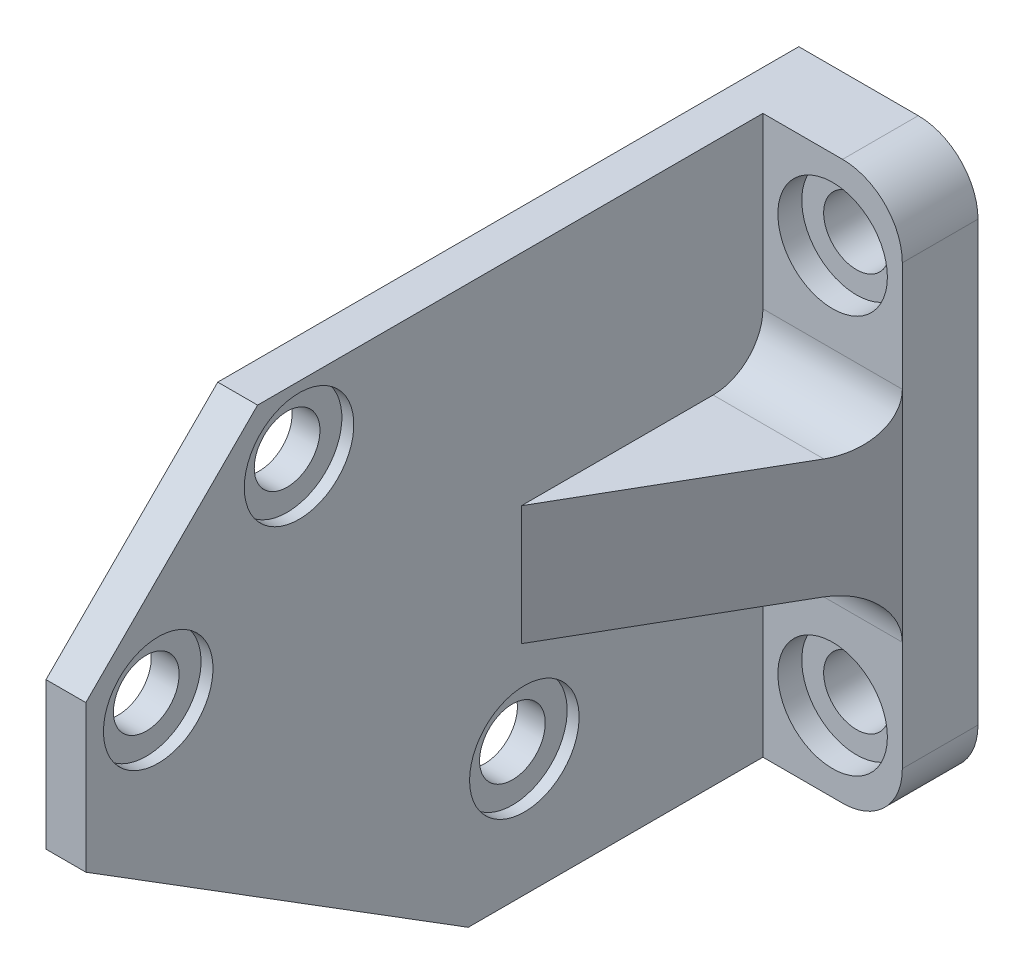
ISO-10303-21;
HEADER;
FILE_DESCRIPTION(('STEP AP214'),'2;1');
FILE_NAME('part.step','',(''),(''),'','','');
FILE_SCHEMA(('AUTOMOTIVE_DESIGN { 1 0 10303 214 1 1 1 1 }'));
ENDSEC;
DATA;
#1=APPLICATION_CONTEXT('core data for automotive mechanical design processes');
#2=APPLICATION_PROTOCOL_DEFINITION('international standard','automotive_design',2000,#1);
#3=PRODUCT_CONTEXT('',#1,'mechanical');
#4=PRODUCT('Part','Part','',(#3));
#5=PRODUCT_RELATED_PRODUCT_CATEGORY('part','',(#4));
#6=PRODUCT_DEFINITION_FORMATION('','',#4);
#7=PRODUCT_DEFINITION_CONTEXT('part definition',#1,'design');
#8=PRODUCT_DEFINITION('design','',#6,#7);
#9=PRODUCT_DEFINITION_SHAPE('','',#8);
#10=(LENGTH_UNIT() NAMED_UNIT(*) SI_UNIT(.MILLI.,.METRE.));
#11=(NAMED_UNIT(*) PLANE_ANGLE_UNIT() SI_UNIT($,.RADIAN.));
#12=(NAMED_UNIT(*) SI_UNIT($,.STERADIAN.) SOLID_ANGLE_UNIT());
#13=UNCERTAINTY_MEASURE_WITH_UNIT(LENGTH_MEASURE(1.E-05),#10,'distance_accuracy_value','');
#14=(GEOMETRIC_REPRESENTATION_CONTEXT(3) GLOBAL_UNCERTAINTY_ASSIGNED_CONTEXT((#13)) GLOBAL_UNIT_ASSIGNED_CONTEXT((#10,
#11,#12)) REPRESENTATION_CONTEXT('',''));
#15=CARTESIAN_POINT('',(0.,0.,0.));
#16=DIRECTION('',(0.,0.,1.));
#17=DIRECTION('',(1.,0.,0.));
#18=AXIS2_PLACEMENT_3D('',#15,#16,#17);
#19=CARTESIAN_POINT('',(0.,0.,0.));
#20=DIRECTION('',(0.,0.,-1.));
#21=DIRECTION('',(1.,0.,0.));
#22=AXIS2_PLACEMENT_3D('',#19,#20,#21);
#23=PLANE('',#22);
#24=CARTESIAN_POINT('',(19.5,-10.,0.));
#25=DIRECTION('',(0.,0.,1.));
#26=DIRECTION('',(1.,0.,0.));
#27=AXIS2_PLACEMENT_3D('',#24,#25,#26);
#28=CIRCLE('',#27,2.75);
#29=CARTESIAN_POINT('',(22.25,-10.,0.));
#30=VERTEX_POINT('',#29);
#31=EDGE_CURVE('E200',#30,#30,#28,.T.);
#32=ORIENTED_EDGE('',*,*,#31,.F.);
#33=EDGE_LOOP('',(#32));
#34=FACE_BOUND('',#33,.T.);
#35=DIRECTION('',(0.,-1.,0.));
#36=VECTOR('',#35,1.);
#37=CARTESIAN_POINT('',(23.,-14.,0.));
#38=LINE('',#37,#36);
#39=CARTESIAN_POINT('',(23.,-5.5,0.));
#40=VERTEX_POINT('',#39);
#41=CARTESIAN_POINT('',(23.,-11.,0.));
#42=VERTEX_POINT('',#41);
#43=EDGE_CURVE('E203',#40,#42,#38,.T.);
#44=ORIENTED_EDGE('',*,*,#43,.F.);
#45=DIRECTION('',(-1.,0.,0.));
#46=VECTOR('',#45,1.);
#47=CARTESIAN_POINT('',(16.,-5.5,0.));
#48=LINE('',#47,#46);
#49=CARTESIAN_POINT('',(16.,-5.5,0.));
#50=VERTEX_POINT('',#49);
#51=EDGE_CURVE('E327',#40,#50,#48,.T.);
#52=ORIENTED_EDGE('',*,*,#51,.T.);
#53=DIRECTION('',(0.,1.,0.));
#54=VECTOR('',#53,1.);
#55=CARTESIAN_POINT('',(16.,-14.,0.));
#56=LINE('',#55,#54);
#57=CARTESIAN_POINT('',(16.,-14.,0.));
#58=VERTEX_POINT('',#57);
#59=EDGE_CURVE('E211',#58,#50,#56,.T.);
#60=ORIENTED_EDGE('',*,*,#59,.F.);
#61=DIRECTION('',(-1.,0.,0.));
#62=VECTOR('',#61,1.);
#63=CARTESIAN_POINT('',(23.,-14.,0.));
#64=LINE('',#63,#62);
#65=CARTESIAN_POINT('',(20.,-14.,0.));
#66=VERTEX_POINT('',#65);
#67=EDGE_CURVE('E208',#66,#58,#64,.T.);
#68=ORIENTED_EDGE('',*,*,#67,.F.);
#69=CARTESIAN_POINT('',(20.,-11.,0.));
#70=DIRECTION('',(0.,0.,-1.));
#71=DIRECTION('',(-1.,0.,0.));
#72=AXIS2_PLACEMENT_3D('',#69,#70,#71);
#73=CIRCLE('',#72,3.);
#74=EDGE_CURVE('E319',#66,#42,#73,.F.);
#75=ORIENTED_EDGE('',*,*,#74,.T.);
#76=EDGE_LOOP('',(#44,#52,#60,#68,#75));
#77=FACE_BOUND('',#76,.T.);
#78=ADVANCED_FACE('F37',(#34,#77),#23,.F.);
#79=CARTESIAN_POINT('',(14.,-14.,34.));
#80=DIRECTION('',(0.,1.,0.));
#81=DIRECTION('',(1.,0.,0.));
#82=AXIS2_PLACEMENT_3D('',#79,#80,#81);
#83=PLANE('',#82);
#84=DIRECTION('',(1.,0.,0.));
#85=VECTOR('',#84,1.);
#86=CARTESIAN_POINT('',(0.,-14.,-3.8));
#87=LINE('',#86,#85);
#88=CARTESIAN_POINT('',(14.,-14.,-3.8));
#89=VERTEX_POINT('',#88);
#90=CARTESIAN_POINT('',(20.,-14.,-3.8));
#91=VERTEX_POINT('',#90);
#92=EDGE_CURVE('E222',#89,#91,#87,.T.);
#93=ORIENTED_EDGE('',*,*,#92,.T.);
#94=DIRECTION('',(0.,0.,-1.));
#95=VECTOR('',#94,1.);
#96=CARTESIAN_POINT('',(20.,-14.,34.));
#97=LINE('',#96,#95);
#98=EDGE_CURVE('E317',#91,#66,#97,.F.);
#99=ORIENTED_EDGE('',*,*,#98,.T.);
#100=ORIENTED_EDGE('',*,*,#67,.T.);
#101=DIRECTION('',(0.,0.,-1.));
#102=VECTOR('',#101,1.);
#103=CARTESIAN_POINT('',(16.,-14.,34.));
#104=LINE('',#103,#102);
#105=CARTESIAN_POINT('',(16.,-14.,14.7959856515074));
#106=VERTEX_POINT('',#105);
#107=EDGE_CURVE('E285',#106,#58,#104,.T.);
#108=ORIENTED_EDGE('',*,*,#107,.F.);
#109=DIRECTION('',(1.,0.,0.));
#110=VECTOR('',#109,1.);
#111=CARTESIAN_POINT('',(14.,-14.,14.7959856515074));
#112=LINE('',#111,#110);
#113=CARTESIAN_POINT('',(14.,-14.,14.7959856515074));
#114=VERTEX_POINT('',#113);
#115=EDGE_CURVE('E236',#114,#106,#112,.T.);
#116=ORIENTED_EDGE('',*,*,#115,.F.);
#117=DIRECTION('',(0.,0.,-1.));
#118=VECTOR('',#117,1.);
#119=CARTESIAN_POINT('',(14.,-14.,34.));
#120=LINE('',#119,#118);
#121=EDGE_CURVE('E293',#114,#89,#120,.T.);
#122=ORIENTED_EDGE('',*,*,#121,.T.);
#123=EDGE_LOOP('',(#93,#99,#100,#108,#116,#122));
#124=FACE_BOUND('',#123,.T.);
#125=ADVANCED_FACE('F385',(#124),#83,.F.);
#126=CARTESIAN_POINT('',(14.,14.,34.));
#127=DIRECTION('',(0.,-1.,0.));
#128=DIRECTION('',(-1.,0.,0.));
#129=AXIS2_PLACEMENT_3D('',#126,#127,#128);
#130=PLANE('',#129);
#131=DIRECTION('',(1.,0.,0.));
#132=VECTOR('',#131,1.);
#133=CARTESIAN_POINT('',(23.,14.,0.));
#134=LINE('',#133,#132);
#135=CARTESIAN_POINT('',(16.,14.,0.));
#136=VERTEX_POINT('',#135);
#137=CARTESIAN_POINT('',(20.,14.,0.));
#138=VERTEX_POINT('',#137);
#139=EDGE_CURVE('E214',#136,#138,#134,.T.);
#140=ORIENTED_EDGE('',*,*,#139,.T.);
#141=DIRECTION('',(0.,0.,-1.));
#142=VECTOR('',#141,1.);
#143=CARTESIAN_POINT('',(20.,14.,34.));
#144=LINE('',#143,#142);
#145=CARTESIAN_POINT('',(20.,14.,-3.8));
#146=VERTEX_POINT('',#145);
#147=EDGE_CURVE('E322',#138,#146,#144,.T.);
#148=ORIENTED_EDGE('',*,*,#147,.T.);
#149=DIRECTION('',(-1.,0.,0.));
#150=VECTOR('',#149,1.);
#151=CARTESIAN_POINT('',(0.,14.,-3.8));
#152=LINE('',#151,#150);
#153=CARTESIAN_POINT('',(14.,14.,-3.8));
#154=VERTEX_POINT('',#153);
#155=EDGE_CURVE('E228',#146,#154,#152,.T.);
#156=ORIENTED_EDGE('',*,*,#155,.T.);
#157=DIRECTION('',(0.,0.,-1.));
#158=VECTOR('',#157,1.);
#159=CARTESIAN_POINT('',(14.,14.,34.));
#160=LINE('',#159,#158);
#161=CARTESIAN_POINT('',(14.,14.,25.3758703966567));
#162=VERTEX_POINT('',#161);
#163=EDGE_CURVE('E291',#162,#154,#160,.T.);
#164=ORIENTED_EDGE('',*,*,#163,.F.);
#165=DIRECTION('',(-1.,0.,0.));
#166=VECTOR('',#165,1.);
#167=CARTESIAN_POINT('',(14.,14.,25.3758703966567));
#168=LINE('',#167,#166);
#169=CARTESIAN_POINT('',(16.,14.,25.3758703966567));
#170=VERTEX_POINT('',#169);
#171=EDGE_CURVE('E246',#170,#162,#168,.T.);
#172=ORIENTED_EDGE('',*,*,#171,.F.);
#173=DIRECTION('',(0.,0.,-1.));
#174=VECTOR('',#173,1.);
#175=CARTESIAN_POINT('',(16.,14.,34.));
#176=LINE('',#175,#174);
#177=EDGE_CURVE('E282',#170,#136,#176,.T.);
#178=ORIENTED_EDGE('',*,*,#177,.T.);
#179=EDGE_LOOP('',(#140,#148,#156,#164,#172,#178));
#180=FACE_BOUND('',#179,.T.);
#181=ADVANCED_FACE('F366',(#180),#130,.F.);
#182=CARTESIAN_POINT('',(19.5,-10.,0.));
#183=DIRECTION('',(0.,0.,1.));
#184=DIRECTION('',(-1.,0.,0.));
#185=AXIS2_PLACEMENT_3D('',#182,#183,#184);
#186=CYLINDRICAL_SURFACE('',#185,1.65);
#187=CARTESIAN_POINT('',(19.5,-10.,-1.2));
#188=DIRECTION('',(0.,0.,1.));
#189=DIRECTION('',(1.,0.,0.));
#190=AXIS2_PLACEMENT_3D('',#187,#188,#189);
#191=CIRCLE('',#190,1.65);
#192=CARTESIAN_POINT('',(21.15,-10.,-1.2));
#193=VERTEX_POINT('',#192);
#194=EDGE_CURVE('E196',#193,#193,#191,.F.);
#195=ORIENTED_EDGE('',*,*,#194,.F.);
#196=EDGE_LOOP('',(#195));
#197=FACE_BOUND('',#196,.T.);
#198=CARTESIAN_POINT('',(19.5,-10.,-3.8));
#199=DIRECTION('',(0.,0.,1.));
#200=DIRECTION('',(1.,0.,0.));
#201=AXIS2_PLACEMENT_3D('',#198,#199,#200);
#202=CIRCLE('',#201,1.65);
#203=CARTESIAN_POINT('',(21.15,-10.,-3.8));
#204=VERTEX_POINT('',#203);
#205=EDGE_CURVE('E230',#204,#204,#202,.F.);
#206=ORIENTED_EDGE('',*,*,#205,.T.);
#207=EDGE_LOOP('',(#206));
#208=FACE_BOUND('',#207,.T.);
#209=ADVANCED_FACE('F463',(#197,#208),#186,.F.);
#210=CARTESIAN_POINT('',(19.5,10.,0.));
#211=DIRECTION('',(0.,0.,1.));
#212=DIRECTION('',(-1.,0.,0.));
#213=AXIS2_PLACEMENT_3D('',#210,#211,#212);
#214=CYLINDRICAL_SURFACE('',#213,1.65);
#215=CARTESIAN_POINT('',(19.5,10.,-1.2));
#216=DIRECTION('',(0.,0.,1.));
#217=DIRECTION('',(1.,0.,0.));
#218=AXIS2_PLACEMENT_3D('',#215,#216,#217);
#219=CIRCLE('',#218,1.65);
#220=CARTESIAN_POINT('',(21.15,10.,-1.2));
#221=VERTEX_POINT('',#220);
#222=EDGE_CURVE('E193',#221,#221,#219,.F.);
#223=ORIENTED_EDGE('',*,*,#222,.F.);
#224=EDGE_LOOP('',(#223));
#225=FACE_BOUND('',#224,.T.);
#226=CARTESIAN_POINT('',(19.5,10.,-3.8));
#227=DIRECTION('',(0.,0.,1.));
#228=DIRECTION('',(1.,0.,0.));
#229=AXIS2_PLACEMENT_3D('',#226,#227,#228);
#230=CIRCLE('',#229,1.65);
#231=CARTESIAN_POINT('',(21.15,10.,-3.8));
#232=VERTEX_POINT('',#231);
#233=EDGE_CURVE('E217',#232,#232,#230,.F.);
#234=ORIENTED_EDGE('',*,*,#233,.T.);
#235=EDGE_LOOP('',(#234));
#236=FACE_BOUND('',#235,.T.);
#237=ADVANCED_FACE('F466',(#225,#236),#214,.F.);
#238=CARTESIAN_POINT('',(14.,3.66947788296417,30.3646752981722));
#239=DIRECTION('',(1.,0.,0.));
#240=DIRECTION('',(0.,0.,1.));
#241=AXIS2_PLACEMENT_3D('',#238,#239,#240);
#242=CYLINDRICAL_SURFACE('',#241,1.65);
#243=CARTESIAN_POINT('',(14.,3.66947788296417,30.3646752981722));
#244=DIRECTION('',(-1.,0.,0.));
#245=DIRECTION('',(0.,0.,1.));
#246=AXIS2_PLACEMENT_3D('',#243,#244,#245);
#247=CIRCLE('',#246,1.65);
#248=CARTESIAN_POINT('',(14.,3.66947788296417,32.0146752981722));
#249=VERTEX_POINT('',#248);
#250=EDGE_CURVE('E274',#249,#249,#247,.T.);
#251=ORIENTED_EDGE('',*,*,#250,.T.);
#252=EDGE_LOOP('',(#251));
#253=FACE_BOUND('',#252,.T.);
#254=CARTESIAN_POINT('',(15.4,3.66947788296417,30.3646752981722));
#255=DIRECTION('',(-1.,0.,0.));
#256=DIRECTION('',(0.,0.,1.));
#257=AXIS2_PLACEMENT_3D('',#254,#255,#256);
#258=CIRCLE('',#257,1.65);
#259=CARTESIAN_POINT('',(15.4,3.66947788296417,32.0146752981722));
#260=VERTEX_POINT('',#259);
#261=EDGE_CURVE('E269',#260,#260,#258,.F.);
#262=ORIENTED_EDGE('',*,*,#261,.T.);
#263=EDGE_LOOP('',(#262));
#264=FACE_BOUND('',#263,.T.);
#265=ADVANCED_FACE('F474',(#253,#264),#242,.F.);
#266=CARTESIAN_POINT('',(14.,10.7405456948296,23.2936074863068));
#267=DIRECTION('',(1.,0.,0.));
#268=DIRECTION('',(0.,0.,1.));
#269=AXIS2_PLACEMENT_3D('',#266,#267,#268);
#270=CYLINDRICAL_SURFACE('',#269,1.65);
#271=CARTESIAN_POINT('',(14.,10.7405456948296,23.2936074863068));
#272=DIRECTION('',(-1.,0.,0.));
#273=DIRECTION('',(0.,0.,1.));
#274=AXIS2_PLACEMENT_3D('',#271,#272,#273);
#275=CIRCLE('',#274,1.65);
#276=CARTESIAN_POINT('',(14.,10.7405456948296,24.9436074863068));
#277=VERTEX_POINT('',#276);
#278=EDGE_CURVE('E270',#277,#277,#275,.T.);
#279=ORIENTED_EDGE('',*,*,#278,.T.);
#280=EDGE_LOOP('',(#279));
#281=FACE_BOUND('',#280,.T.);
#282=CARTESIAN_POINT('',(15.4,10.7405456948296,23.2936074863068));
#283=DIRECTION('',(-1.,0.,0.));
#284=DIRECTION('',(0.,0.,1.));
#285=AXIS2_PLACEMENT_3D('',#282,#283,#284);
#286=CIRCLE('',#285,1.65);
#287=CARTESIAN_POINT('',(15.4,10.7405456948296,24.9436074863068));
#288=VERTEX_POINT('',#287);
#289=EDGE_CURVE('E253',#288,#288,#286,.F.);
#290=ORIENTED_EDGE('',*,*,#289,.T.);
#291=EDGE_LOOP('',(#290));
#292=FACE_BOUND('',#291,.T.);
#293=ADVANCED_FACE('F506',(#281,#292),#270,.F.);
#294=CARTESIAN_POINT('',(14.,-7.64423061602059,11.979898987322));
#295=DIRECTION('',(1.,0.,0.));
#296=DIRECTION('',(0.,0.,1.));
#297=AXIS2_PLACEMENT_3D('',#294,#295,#296);
#298=CYLINDRICAL_SURFACE('',#297,1.65);
#299=CARTESIAN_POINT('',(14.,-7.64423061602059,11.979898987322));
#300=DIRECTION('',(-1.,0.,0.));
#301=DIRECTION('',(0.,0.,1.));
#302=AXIS2_PLACEMENT_3D('',#299,#300,#301);
#303=CIRCLE('',#302,1.65);
#304=CARTESIAN_POINT('',(14.,-7.64423061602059,13.629898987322));
#305=VERTEX_POINT('',#304);
#306=EDGE_CURVE('E273',#305,#305,#303,.T.);
#307=ORIENTED_EDGE('',*,*,#306,.T.);
#308=EDGE_LOOP('',(#307));
#309=FACE_BOUND('',#308,.T.);
#310=CARTESIAN_POINT('',(15.4,-7.64423061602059,11.979898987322));
#311=DIRECTION('',(-1.,0.,0.));
#312=DIRECTION('',(0.,0.,1.));
#313=AXIS2_PLACEMENT_3D('',#310,#311,#312);
#314=CIRCLE('',#313,1.65);
#315=CARTESIAN_POINT('',(15.4,-7.64423061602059,13.629898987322));
#316=VERTEX_POINT('',#315);
#317=EDGE_CURVE('E265',#316,#316,#314,.F.);
#318=ORIENTED_EDGE('',*,*,#317,.T.);
#319=EDGE_LOOP('',(#318));
#320=FACE_BOUND('',#319,.T.);
#321=ADVANCED_FACE('F509',(#309,#320),#298,.F.);
#322=CARTESIAN_POINT('',(0.,0.,34.));
#323=DIRECTION('',(0.,0.,1.));
#324=DIRECTION('',(-1.,0.,0.));
#325=AXIS2_PLACEMENT_3D('',#322,#323,#324);
#326=PLANE('',#325);
#327=DIRECTION('',(1.,0.,0.));
#328=VECTOR('',#327,1.);
#329=CARTESIAN_POINT('',(14.,-2.,34.));
#330=LINE('',#329,#328);
#331=CARTESIAN_POINT('',(14.,-2.,34.));
#332=VERTEX_POINT('',#331);
#333=CARTESIAN_POINT('',(16.,-2.,34.));
#334=VERTEX_POINT('',#333);
#335=EDGE_CURVE('E235',#332,#334,#330,.T.);
#336=ORIENTED_EDGE('',*,*,#335,.T.);
#337=DIRECTION('',(0.,1.,0.));
#338=VECTOR('',#337,1.);
#339=CARTESIAN_POINT('',(16.,-14.,34.));
#340=LINE('',#339,#338);
#341=CARTESIAN_POINT('',(16.,5.37587039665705,33.9999999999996));
#342=VERTEX_POINT('',#341);
#343=EDGE_CURVE('E279',#334,#342,#340,.T.);
#344=ORIENTED_EDGE('',*,*,#343,.T.);
#345=DIRECTION('',(1.,0.,0.));
#346=VECTOR('',#345,1.);
#347=CARTESIAN_POINT('',(14.,5.37587039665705,33.9999999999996));
#348=LINE('',#347,#346);
#349=CARTESIAN_POINT('',(14.,5.37587039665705,33.9999999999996));
#350=VERTEX_POINT('',#349);
#351=EDGE_CURVE('E243',#350,#342,#348,.T.);
#352=ORIENTED_EDGE('',*,*,#351,.F.);
#353=DIRECTION('',(0.,1.,0.));
#354=VECTOR('',#353,1.);
#355=CARTESIAN_POINT('',(14.,14.,34.));
#356=LINE('',#355,#354);
#357=EDGE_CURVE('E288',#332,#350,#356,.T.);
#358=ORIENTED_EDGE('',*,*,#357,.F.);
#359=EDGE_LOOP('',(#336,#344,#352,#358));
#360=FACE_BOUND('',#359,.T.);
#361=ADVANCED_FACE('F398',(#360),#326,.T.);
#362=CARTESIAN_POINT('',(14.,14.,34.));
#363=DIRECTION('',(1.,0.,0.));
#364=DIRECTION('',(0.,0.,1.));
#365=AXIS2_PLACEMENT_3D('',#362,#363,#364);
#366=PLANE('',#365);
#367=DIRECTION('',(0.,1.,0.));
#368=VECTOR('',#367,1.);
#369=CARTESIAN_POINT('',(14.,14.,-1.8));
#370=LINE('',#369,#368);
#371=CARTESIAN_POINT('',(14.,-10.5,-1.8));
#372=VERTEX_POINT('',#371);
#373=CARTESIAN_POINT('',(14.,10.5,-1.8));
#374=VERTEX_POINT('',#373);
#375=EDGE_CURVE('E11',#372,#374,#370,.T.);
#376=ORIENTED_EDGE('',*,*,#375,.F.);
#377=DIRECTION('',(0.,0.,-1.));
#378=VECTOR('',#377,1.);
#379=CARTESIAN_POINT('',(14.,-10.5,-1.8));
#380=LINE('',#379,#378);
#381=CARTESIAN_POINT('',(14.,-10.5,-3.8));
#382=VERTEX_POINT('',#381);
#383=EDGE_CURVE('E161',#372,#382,#380,.T.);
#384=ORIENTED_EDGE('',*,*,#383,.T.);
#385=DIRECTION('',(0.,-1.,0.));
#386=VECTOR('',#385,1.);
#387=CARTESIAN_POINT('',(14.,0.,-3.8));
#388=LINE('',#387,#386);
#389=EDGE_CURVE('E220',#382,#89,#388,.T.);
#390=ORIENTED_EDGE('',*,*,#389,.T.);
#391=ORIENTED_EDGE('',*,*,#121,.F.);
#392=DIRECTION('',(0.,-0.529919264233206,-0.848048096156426));
#393=VECTOR('',#392,1.);
#394=CARTESIAN_POINT('',(14.,-2.,34.));
#395=LINE('',#394,#393);
#396=EDGE_CURVE('E233',#332,#114,#395,.T.);
#397=ORIENTED_EDGE('',*,*,#396,.F.);
#398=ORIENTED_EDGE('',*,*,#357,.T.);
#399=DIRECTION('',(0.,-0.707106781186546,0.707106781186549));
#400=VECTOR('',#399,1.);
#401=CARTESIAN_POINT('',(14.,5.37587039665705,33.9999999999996));
#402=LINE('',#401,#400);
#403=EDGE_CURVE('E239',#162,#350,#402,.T.);
#404=ORIENTED_EDGE('',*,*,#403,.F.);
#405=ORIENTED_EDGE('',*,*,#163,.T.);
#406=CARTESIAN_POINT('',(14.,10.5,-3.8));
#407=VERTEX_POINT('',#406);
#408=EDGE_CURVE('E169',#154,#407,#388,.T.);
#409=ORIENTED_EDGE('',*,*,#408,.T.);
#410=DIRECTION('',(0.,0.,-1.));
#411=VECTOR('',#410,1.);
#412=CARTESIAN_POINT('',(14.,10.5,-1.8));
#413=LINE('',#412,#411);
#414=EDGE_CURVE('E52',#407,#374,#413,.F.);
#415=ORIENTED_EDGE('',*,*,#414,.T.);
#416=EDGE_LOOP('',(#376,#384,#390,#391,#397,#398,#404,#405,#409,#415));
#417=FACE_BOUND('',#416,.T.);
#418=ORIENTED_EDGE('',*,*,#278,.F.);
#419=EDGE_LOOP('',(#418));
#420=FACE_BOUND('',#419,.T.);
#421=ORIENTED_EDGE('',*,*,#250,.F.);
#422=EDGE_LOOP('',(#421));
#423=FACE_BOUND('',#422,.T.);
#424=ORIENTED_EDGE('',*,*,#306,.F.);
#425=EDGE_LOOP('',(#424));
#426=FACE_BOUND('',#425,.T.);
#427=ADVANCED_FACE('F165',(#417,#420,#423,#426),#366,.F.);
#428=CARTESIAN_POINT('',(23.,14.,34.));
#429=DIRECTION('',(-1.,0.,0.));
#430=DIRECTION('',(0.,0.,-1.));
#431=AXIS2_PLACEMENT_3D('',#428,#429,#430);
#432=PLANE('',#431);
#433=CARTESIAN_POINT('',(23.,5.5,0.));
#434=VERTEX_POINT('',#433);
#435=EDGE_CURVE('E61',#434,#40,#38,.T.);
#436=ORIENTED_EDGE('',*,*,#435,.T.);
#437=ORIENTED_EDGE('',*,*,#43,.T.);
#438=DIRECTION('',(0.,0.,-1.));
#439=VECTOR('',#438,1.);
#440=CARTESIAN_POINT('',(23.,-11.,34.));
#441=LINE('',#440,#439);
#442=CARTESIAN_POINT('',(23.,-11.,-3.8));
#443=VERTEX_POINT('',#442);
#444=EDGE_CURVE('E310',#42,#443,#441,.T.);
#445=ORIENTED_EDGE('',*,*,#444,.T.);
#446=DIRECTION('',(0.,1.,0.));
#447=VECTOR('',#446,1.);
#448=CARTESIAN_POINT('',(23.,0.,-3.8));
#449=LINE('',#448,#447);
#450=CARTESIAN_POINT('',(23.,11.,-3.8));
#451=VERTEX_POINT('',#450);
#452=EDGE_CURVE('E225',#443,#451,#449,.T.);
#453=ORIENTED_EDGE('',*,*,#452,.T.);
#454=DIRECTION('',(0.,0.,-1.));
#455=VECTOR('',#454,1.);
#456=CARTESIAN_POINT('',(23.,11.,34.));
#457=LINE('',#456,#455);
#458=CARTESIAN_POINT('',(23.,11.,0.));
#459=VERTEX_POINT('',#458);
#460=EDGE_CURVE('E306',#451,#459,#457,.F.);
#461=ORIENTED_EDGE('',*,*,#460,.T.);
#462=EDGE_CURVE('E206',#459,#434,#38,.T.);
#463=ORIENTED_EDGE('',*,*,#462,.T.);
#464=EDGE_LOOP('',(#436,#437,#445,#453,#461,#463));
#465=FACE_BOUND('',#464,.T.);
#466=ADVANCED_FACE('F376',(#465),#432,.F.);
#467=CARTESIAN_POINT('',(16.,-14.,34.));
#468=DIRECTION('',(1.,0.,0.));
#469=DIRECTION('',(0.,0.,1.));
#470=AXIS2_PLACEMENT_3D('',#467,#468,#469);
#471=PLANE('',#470);
#472=ORIENTED_EDGE('',*,*,#59,.T.);
#473=CARTESIAN_POINT('',(16.,-5.5,2.5));
#474=DIRECTION('',(1.,0.,0.));
#475=DIRECTION('',(0.,0.,-1.));
#476=AXIS2_PLACEMENT_3D('',#473,#474,#475);
#477=CIRCLE('',#476,2.5);
#478=CARTESIAN_POINT('',(16.,-3.,2.5));
#479=VERTEX_POINT('',#478);
#480=EDGE_CURVE('E332',#50,#479,#477,.T.);
#481=ORIENTED_EDGE('',*,*,#480,.T.);
#482=DIRECTION('',(0.,0.,-1.));
#483=VECTOR('',#482,1.);
#484=CARTESIAN_POINT('',(16.,-3.,34.));
#485=LINE('',#484,#483);
#486=CARTESIAN_POINT('',(16.,-3.,12.1243556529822));
#487=VERTEX_POINT('',#486);
#488=EDGE_CURVE('E178',#487,#479,#485,.T.);
#489=ORIENTED_EDGE('',*,*,#488,.F.);
#490=DIRECTION('',(0.,-1.,0.));
#491=VECTOR('',#490,1.);
#492=CARTESIAN_POINT('',(16.,-14.,12.1243556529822));
#493=LINE('',#492,#491);
#494=CARTESIAN_POINT('',(16.,3.,12.1243556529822));
#495=VERTEX_POINT('',#494);
#496=EDGE_CURVE('E186',#487,#495,#493,.F.);
#497=ORIENTED_EDGE('',*,*,#496,.T.);
#498=DIRECTION('',(0.,0.,-1.));
#499=VECTOR('',#498,1.);
#500=CARTESIAN_POINT('',(16.,3.,34.));
#501=LINE('',#500,#499);
#502=CARTESIAN_POINT('',(16.,3.,2.5));
#503=VERTEX_POINT('',#502);
#504=EDGE_CURVE('E183',#495,#503,#501,.T.);
#505=ORIENTED_EDGE('',*,*,#504,.T.);
#506=CARTESIAN_POINT('',(16.,5.5,2.5));
#507=DIRECTION('',(1.,0.,0.));
#508=DIRECTION('',(0.,0.,-1.));
#509=AXIS2_PLACEMENT_3D('',#506,#507,#508);
#510=CIRCLE('',#509,2.5);
#511=CARTESIAN_POINT('',(16.,5.5,0.));
#512=VERTEX_POINT('',#511);
#513=EDGE_CURVE('E330',#503,#512,#510,.T.);
#514=ORIENTED_EDGE('',*,*,#513,.T.);
#515=EDGE_CURVE('E210',#512,#136,#56,.T.);
#516=ORIENTED_EDGE('',*,*,#515,.T.);
#517=ORIENTED_EDGE('',*,*,#177,.F.);
#518=DIRECTION('',(0.,-0.707106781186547,0.707106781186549));
#519=VECTOR('',#518,1.);
#520=CARTESIAN_POINT('',(16.,-4.31206480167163,43.6879351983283));
#521=LINE('',#520,#519);
#522=EDGE_CURVE('E296',#170,#342,#521,.T.);
#523=ORIENTED_EDGE('',*,*,#522,.T.);
#524=ORIENTED_EDGE('',*,*,#343,.F.);
#525=DIRECTION('',(0.,-0.529919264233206,-0.848048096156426));
#526=VECTOR('',#525,1.);
#527=CARTESIAN_POINT('',(16.,-5.36977311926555,28.607235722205));
#528=LINE('',#527,#526);
#529=EDGE_CURVE('E304',#334,#106,#528,.T.);
#530=ORIENTED_EDGE('',*,*,#529,.T.);
#531=ORIENTED_EDGE('',*,*,#107,.T.);
#532=EDGE_LOOP('',(#472,#481,#489,#497,#505,#514,#516,#517,#523,#524,#530,#531));
#533=FACE_BOUND('',#532,.T.);
#534=CARTESIAN_POINT('',(16.,10.7405456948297,23.2936074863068));
#535=DIRECTION('',(-1.,0.,0.));
#536=DIRECTION('',(0.,0.,1.));
#537=AXIS2_PLACEMENT_3D('',#534,#535,#536);
#538=CIRCLE('',#537,2.75);
#539=CARTESIAN_POINT('',(16.,10.7405456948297,26.0436074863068));
#540=VERTEX_POINT('',#539);
#541=EDGE_CURVE('E254',#540,#540,#538,.T.);
#542=ORIENTED_EDGE('',*,*,#541,.T.);
#543=EDGE_LOOP('',(#542));
#544=FACE_BOUND('',#543,.T.);
#545=CARTESIAN_POINT('',(16.,3.66947788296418,30.3646752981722));
#546=DIRECTION('',(-1.,0.,0.));
#547=DIRECTION('',(0.,0.,1.));
#548=AXIS2_PLACEMENT_3D('',#545,#546,#547);
#549=CIRCLE('',#548,2.75);
#550=CARTESIAN_POINT('',(16.,3.66947788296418,33.1146752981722));
#551=VERTEX_POINT('',#550);
#552=EDGE_CURVE('E249',#551,#551,#549,.T.);
#553=ORIENTED_EDGE('',*,*,#552,.T.);
#554=EDGE_LOOP('',(#553));
#555=FACE_BOUND('',#554,.T.);
#556=CARTESIAN_POINT('',(16.,-7.64423061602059,11.979898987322));
#557=DIRECTION('',(-1.,0.,0.));
#558=DIRECTION('',(0.,0.,1.));
#559=AXIS2_PLACEMENT_3D('',#556,#557,#558);
#560=CIRCLE('',#559,2.75);
#561=CARTESIAN_POINT('',(16.,-7.64423061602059,14.729898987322));
#562=VERTEX_POINT('',#561);
#563=EDGE_CURVE('E266',#562,#562,#560,.T.);
#564=ORIENTED_EDGE('',*,*,#563,.T.);
#565=EDGE_LOOP('',(#564));
#566=FACE_BOUND('',#565,.T.);
#567=ADVANCED_FACE('F356',(#533,#544,#555,#566),#471,.T.);
#568=CARTESIAN_POINT('',(15.4,-7.64423061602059,11.979898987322));
#569=DIRECTION('',(1.,0.,0.));
#570=DIRECTION('',(0.,0.,1.));
#571=AXIS2_PLACEMENT_3D('',#568,#569,#570);
#572=PLANE('',#571);
#573=CARTESIAN_POINT('',(15.4,-7.64423061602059,11.979898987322));
#574=DIRECTION('',(-1.,0.,0.));
#575=DIRECTION('',(0.,0.,1.));
#576=AXIS2_PLACEMENT_3D('',#573,#574,#575);
#577=CIRCLE('',#576,2.75);
#578=CARTESIAN_POINT('',(15.4,-7.64423061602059,14.729898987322));
#579=VERTEX_POINT('',#578);
#580=EDGE_CURVE('E262',#579,#579,#577,.T.);
#581=ORIENTED_EDGE('',*,*,#580,.F.);
#582=EDGE_LOOP('',(#581));
#583=FACE_BOUND('',#582,.T.);
#584=ORIENTED_EDGE('',*,*,#317,.F.);
#585=EDGE_LOOP('',(#584));
#586=FACE_BOUND('',#585,.T.);
#587=ADVANCED_FACE('F499',(#583,#586),#572,.T.);
#588=CARTESIAN_POINT('',(15.4,-7.64423061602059,11.979898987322));
#589=DIRECTION('',(1.,0.,0.));
#590=DIRECTION('',(0.,0.,1.));
#591=AXIS2_PLACEMENT_3D('',#588,#589,#590);
#592=CYLINDRICAL_SURFACE('',#591,2.75);
#593=ORIENTED_EDGE('',*,*,#580,.T.);
#594=EDGE_LOOP('',(#593));
#595=FACE_BOUND('',#594,.T.);
#596=ORIENTED_EDGE('',*,*,#563,.F.);
#597=EDGE_LOOP('',(#596));
#598=FACE_BOUND('',#597,.T.);
#599=ADVANCED_FACE('F487',(#595,#598),#592,.F.);
#600=CARTESIAN_POINT('',(15.4,10.7405456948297,23.2936074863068));
#601=DIRECTION('',(1.,0.,0.));
#602=DIRECTION('',(0.,0.,1.));
#603=AXIS2_PLACEMENT_3D('',#600,#601,#602);
#604=PLANE('',#603);
#605=CARTESIAN_POINT('',(15.4,10.7405456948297,23.2936074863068));
#606=DIRECTION('',(-1.,0.,0.));
#607=DIRECTION('',(0.,0.,1.));
#608=AXIS2_PLACEMENT_3D('',#605,#606,#607);
#609=CIRCLE('',#608,2.75);
#610=CARTESIAN_POINT('',(15.4,10.7405456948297,26.0436074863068));
#611=VERTEX_POINT('',#610);
#612=EDGE_CURVE('E250',#611,#611,#609,.T.);
#613=ORIENTED_EDGE('',*,*,#612,.F.);
#614=EDGE_LOOP('',(#613));
#615=FACE_BOUND('',#614,.T.);
#616=ORIENTED_EDGE('',*,*,#289,.F.);
#617=EDGE_LOOP('',(#616));
#618=FACE_BOUND('',#617,.T.);
#619=ADVANCED_FACE('F483',(#615,#618),#604,.T.);
#620=CARTESIAN_POINT('',(15.4,10.7405456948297,23.2936074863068));
#621=DIRECTION('',(1.,0.,0.));
#622=DIRECTION('',(0.,0.,1.));
#623=AXIS2_PLACEMENT_3D('',#620,#621,#622);
#624=CYLINDRICAL_SURFACE('',#623,2.75);
#625=ORIENTED_EDGE('',*,*,#612,.T.);
#626=EDGE_LOOP('',(#625));
#627=FACE_BOUND('',#626,.T.);
#628=ORIENTED_EDGE('',*,*,#541,.F.);
#629=EDGE_LOOP('',(#628));
#630=FACE_BOUND('',#629,.T.);
#631=ADVANCED_FACE('F486',(#627,#630),#624,.F.);
#632=CARTESIAN_POINT('',(15.4,3.66947788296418,30.3646752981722));
#633=DIRECTION('',(1.,0.,0.));
#634=DIRECTION('',(0.,0.,1.));
#635=AXIS2_PLACEMENT_3D('',#632,#633,#634);
#636=PLANE('',#635);
#637=CARTESIAN_POINT('',(15.4,3.66947788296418,30.3646752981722));
#638=DIRECTION('',(-1.,0.,0.));
#639=DIRECTION('',(0.,0.,1.));
#640=AXIS2_PLACEMENT_3D('',#637,#638,#639);
#641=CIRCLE('',#640,2.75);
#642=CARTESIAN_POINT('',(15.4,3.66947788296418,33.1146752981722));
#643=VERTEX_POINT('',#642);
#644=EDGE_CURVE('E257',#643,#643,#641,.T.);
#645=ORIENTED_EDGE('',*,*,#644,.F.);
#646=EDGE_LOOP('',(#645));
#647=FACE_BOUND('',#646,.T.);
#648=ORIENTED_EDGE('',*,*,#261,.F.);
#649=EDGE_LOOP('',(#648));
#650=FACE_BOUND('',#649,.T.);
#651=ADVANCED_FACE('F491',(#647,#650),#636,.T.);
#652=CARTESIAN_POINT('',(15.4,3.66947788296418,30.3646752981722));
#653=DIRECTION('',(1.,0.,0.));
#654=DIRECTION('',(0.,0.,1.));
#655=AXIS2_PLACEMENT_3D('',#652,#653,#654);
#656=CYLINDRICAL_SURFACE('',#655,2.75);
#657=ORIENTED_EDGE('',*,*,#644,.T.);
#658=EDGE_LOOP('',(#657));
#659=FACE_BOUND('',#658,.T.);
#660=ORIENTED_EDGE('',*,*,#552,.F.);
#661=EDGE_LOOP('',(#660));
#662=FACE_BOUND('',#661,.T.);
#663=ADVANCED_FACE('F482',(#659,#662),#656,.F.);
#664=CARTESIAN_POINT('',(14.,5.37587039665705,33.9999999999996));
#665=DIRECTION('',(0.,-0.707106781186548,-0.707106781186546));
#666=DIRECTION('',(0.,0.707106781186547,-0.707106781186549));
#667=AXIS2_PLACEMENT_3D('',#664,#665,#666);
#668=PLANE('',#667);
#669=ORIENTED_EDGE('',*,*,#522,.F.);
#670=ORIENTED_EDGE('',*,*,#171,.T.);
#671=ORIENTED_EDGE('',*,*,#403,.T.);
#672=ORIENTED_EDGE('',*,*,#351,.T.);
#673=EDGE_LOOP('',(#669,#670,#671,#672));
#674=FACE_BOUND('',#673,.T.);
#675=ADVANCED_FACE('F393',(#674),#668,.F.);
#676=CARTESIAN_POINT('',(14.,-2.,34.));
#677=DIRECTION('',(0.,0.848048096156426,-0.529919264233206));
#678=DIRECTION('',(0.,0.529919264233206,0.848048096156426));
#679=AXIS2_PLACEMENT_3D('',#676,#677,#678);
#680=PLANE('',#679);
#681=ORIENTED_EDGE('',*,*,#529,.F.);
#682=ORIENTED_EDGE('',*,*,#335,.F.);
#683=ORIENTED_EDGE('',*,*,#396,.T.);
#684=ORIENTED_EDGE('',*,*,#115,.T.);
#685=EDGE_LOOP('',(#681,#682,#683,#684));
#686=FACE_BOUND('',#685,.T.);
#687=ADVANCED_FACE('F400',(#686),#680,.F.);
#688=CARTESIAN_POINT('',(0.,0.,-3.8));
#689=DIRECTION('',(0.,0.,-1.));
#690=DIRECTION('',(1.,0.,0.));
#691=AXIS2_PLACEMENT_3D('',#688,#689,#690);
#692=PLANE('',#691);
#693=CARTESIAN_POINT('',(0.,0.,-3.8));
#694=DIRECTION('',(0.,0.,-1.));
#695=DIRECTION('',(-1.,0.,0.));
#696=AXIS2_PLACEMENT_3D('',#693,#694,#695);
#697=CIRCLE('',#696,17.5);
#698=EDGE_CURVE('E162',#407,#382,#697,.T.);
#699=ORIENTED_EDGE('',*,*,#698,.F.);
#700=ORIENTED_EDGE('',*,*,#408,.F.);
#701=ORIENTED_EDGE('',*,*,#155,.F.);
#702=CARTESIAN_POINT('',(20.,11.,-3.8));
#703=DIRECTION('',(0.,0.,-1.));
#704=DIRECTION('',(-1.,0.,0.));
#705=AXIS2_PLACEMENT_3D('',#702,#703,#704);
#706=CIRCLE('',#705,3.);
#707=EDGE_CURVE('E313',#146,#451,#706,.T.);
#708=ORIENTED_EDGE('',*,*,#707,.T.);
#709=ORIENTED_EDGE('',*,*,#452,.F.);
#710=CARTESIAN_POINT('',(20.,-11.,-3.8));
#711=DIRECTION('',(0.,0.,-1.));
#712=DIRECTION('',(-1.,0.,0.));
#713=AXIS2_PLACEMENT_3D('',#710,#711,#712);
#714=CIRCLE('',#713,3.);
#715=EDGE_CURVE('E315',#443,#91,#714,.T.);
#716=ORIENTED_EDGE('',*,*,#715,.T.);
#717=ORIENTED_EDGE('',*,*,#92,.F.);
#718=ORIENTED_EDGE('',*,*,#389,.F.);
#719=EDGE_LOOP('',(#699,#700,#701,#708,#709,#716,#717,#718));
#720=FACE_BOUND('',#719,.T.);
#721=ORIENTED_EDGE('',*,*,#233,.F.);
#722=EDGE_LOOP('',(#721));
#723=FACE_BOUND('',#722,.T.);
#724=ORIENTED_EDGE('',*,*,#205,.F.);
#725=EDGE_LOOP('',(#724));
#726=FACE_BOUND('',#725,.T.);
#727=ADVANCED_FACE('F374',(#720,#723,#726),#692,.T.);
#728=CARTESIAN_POINT('',(19.5,10.,0.));
#729=DIRECTION('',(0.,0.,1.));
#730=DIRECTION('',(1.,0.,0.));
#731=AXIS2_PLACEMENT_3D('',#728,#729,#730);
#732=CIRCLE('',#731,2.75);
#733=CARTESIAN_POINT('',(22.25,10.,0.));
#734=VERTEX_POINT('',#733);
#735=EDGE_CURVE('E190',#734,#734,#732,.T.);
#736=ORIENTED_EDGE('',*,*,#735,.F.);
#737=EDGE_LOOP('',(#736));
#738=FACE_BOUND('',#737,.T.);
#739=ORIENTED_EDGE('',*,*,#515,.F.);
#740=DIRECTION('',(-1.,0.,0.));
#741=VECTOR('',#740,1.);
#742=CARTESIAN_POINT('',(0.,5.5,0.));
#743=LINE('',#742,#741);
#744=EDGE_CURVE('E339',#512,#434,#743,.F.);
#745=ORIENTED_EDGE('',*,*,#744,.T.);
#746=ORIENTED_EDGE('',*,*,#462,.F.);
#747=CARTESIAN_POINT('',(20.,11.,0.));
#748=DIRECTION('',(0.,0.,-1.));
#749=DIRECTION('',(-1.,0.,0.));
#750=AXIS2_PLACEMENT_3D('',#747,#748,#749);
#751=CIRCLE('',#750,3.);
#752=EDGE_CURVE('E325',#459,#138,#751,.F.);
#753=ORIENTED_EDGE('',*,*,#752,.T.);
#754=ORIENTED_EDGE('',*,*,#139,.F.);
#755=EDGE_LOOP('',(#739,#745,#746,#753,#754));
#756=FACE_BOUND('',#755,.T.);
#757=ADVANCED_FACE('F361',(#738,#756),#23,.F.);
#758=CARTESIAN_POINT('',(19.5,-10.,-1.2));
#759=DIRECTION('',(0.,0.,1.));
#760=DIRECTION('',(-1.,0.,0.));
#761=AXIS2_PLACEMENT_3D('',#758,#759,#760);
#762=CYLINDRICAL_SURFACE('',#761,2.75);
#763=CARTESIAN_POINT('',(19.5,-10.,-1.2));
#764=DIRECTION('',(0.,0.,1.));
#765=DIRECTION('',(1.,0.,0.));
#766=AXIS2_PLACEMENT_3D('',#763,#764,#765);
#767=CIRCLE('',#766,2.75);
#768=CARTESIAN_POINT('',(22.25,-10.,-1.2));
#769=VERTEX_POINT('',#768);
#770=EDGE_CURVE('E199',#769,#769,#767,.T.);
#771=ORIENTED_EDGE('',*,*,#770,.F.);
#772=EDGE_LOOP('',(#771));
#773=FACE_BOUND('',#772,.T.);
#774=ORIENTED_EDGE('',*,*,#31,.T.);
#775=EDGE_LOOP('',(#774));
#776=FACE_BOUND('',#775,.T.);
#777=ADVANCED_FACE('F431',(#773,#776),#762,.F.);
#778=CARTESIAN_POINT('',(0.,0.,-1.2));
#779=DIRECTION('',(0.,0.,-1.));
#780=DIRECTION('',(1.,0.,0.));
#781=AXIS2_PLACEMENT_3D('',#778,#779,#780);
#782=PLANE('',#781);
#783=ORIENTED_EDGE('',*,*,#194,.T.);
#784=EDGE_LOOP('',(#783));
#785=FACE_BOUND('',#784,.T.);
#786=ORIENTED_EDGE('',*,*,#770,.T.);
#787=EDGE_LOOP('',(#786));
#788=FACE_BOUND('',#787,.T.);
#789=ADVANCED_FACE('F437',(#785,#788),#782,.F.);
#790=CARTESIAN_POINT('',(19.5,10.,-1.2));
#791=DIRECTION('',(0.,0.,-1.));
#792=DIRECTION('',(1.,0.,0.));
#793=AXIS2_PLACEMENT_3D('',#790,#791,#792);
#794=PLANE('',#793);
#795=CARTESIAN_POINT('',(19.5,10.,-1.2));
#796=DIRECTION('',(0.,0.,1.));
#797=DIRECTION('',(1.,0.,0.));
#798=AXIS2_PLACEMENT_3D('',#795,#796,#797);
#799=CIRCLE('',#798,2.75);
#800=CARTESIAN_POINT('',(22.25,10.,-1.2));
#801=VERTEX_POINT('',#800);
#802=EDGE_CURVE('E189',#801,#801,#799,.T.);
#803=ORIENTED_EDGE('',*,*,#802,.T.);
#804=EDGE_LOOP('',(#803));
#805=FACE_BOUND('',#804,.T.);
#806=ORIENTED_EDGE('',*,*,#222,.T.);
#807=EDGE_LOOP('',(#806));
#808=FACE_BOUND('',#807,.T.);
#809=ADVANCED_FACE('F443',(#805,#808),#794,.F.);
#810=CARTESIAN_POINT('',(19.5,10.,-1.2));
#811=DIRECTION('',(0.,0.,1.));
#812=DIRECTION('',(-1.,0.,0.));
#813=AXIS2_PLACEMENT_3D('',#810,#811,#812);
#814=CYLINDRICAL_SURFACE('',#813,2.75);
#815=ORIENTED_EDGE('',*,*,#802,.F.);
#816=EDGE_LOOP('',(#815));
#817=FACE_BOUND('',#816,.T.);
#818=ORIENTED_EDGE('',*,*,#735,.T.);
#819=EDGE_LOOP('',(#818));
#820=FACE_BOUND('',#819,.T.);
#821=ADVANCED_FACE('F441',(#817,#820),#814,.F.);
#822=CARTESIAN_POINT('',(16.,0.,12.1243556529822));
#823=DIRECTION('',(-0.86602540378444,0.,-0.499999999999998));
#824=DIRECTION('',(0.499999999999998,0.,-0.86602540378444));
#825=AXIS2_PLACEMENT_3D('',#822,#823,#824);
#826=PLANE('',#825);
#827=DIRECTION('',(0.499999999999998,0.,-0.86602540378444));
#828=VECTOR('',#827,1.);
#829=CARTESIAN_POINT('',(16.,-3.,12.1243556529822));
#830=LINE('',#829,#828);
#831=CARTESIAN_POINT('',(21.5566243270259,-3.,2.5));
#832=VERTEX_POINT('',#831);
#833=EDGE_CURVE('E171',#487,#832,#830,.T.);
#834=ORIENTED_EDGE('',*,*,#833,.T.);
#835=CARTESIAN_POINT('',(21.5566243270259,-5.5,2.5));
#836=DIRECTION('',(-0.86602540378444,0.,-0.499999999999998));
#837=DIRECTION('',(0.499999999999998,0.,-0.86602540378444));
#838=AXIS2_PLACEMENT_3D('',#835,#836,#837);
#839=ELLIPSE('',#838,2.88675134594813,2.5);
#840=EDGE_CURVE('E342',#832,#40,#839,.T.);
#841=ORIENTED_EDGE('',*,*,#840,.T.);
#842=ORIENTED_EDGE('',*,*,#435,.F.);
#843=CARTESIAN_POINT('',(21.5566243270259,5.5,2.5));
#844=DIRECTION('',(-0.86602540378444,0.,-0.499999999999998));
#845=DIRECTION('',(-0.499999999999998,0.,0.86602540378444));
#846=AXIS2_PLACEMENT_3D('',#843,#844,#845);
#847=ELLIPSE('',#846,2.88675134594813,2.5);
#848=CARTESIAN_POINT('',(21.5566243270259,3.,2.5));
#849=VERTEX_POINT('',#848);
#850=EDGE_CURVE('E45',#434,#849,#847,.T.);
#851=ORIENTED_EDGE('',*,*,#850,.T.);
#852=DIRECTION('',(0.499999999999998,0.,-0.86602540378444));
#853=VECTOR('',#852,1.);
#854=CARTESIAN_POINT('',(16.,3.,12.1243556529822));
#855=LINE('',#854,#853);
#856=EDGE_CURVE('E175',#495,#849,#855,.T.);
#857=ORIENTED_EDGE('',*,*,#856,.F.);
#858=ORIENTED_EDGE('',*,*,#496,.F.);
#859=EDGE_LOOP('',(#834,#841,#842,#851,#857,#858));
#860=FACE_BOUND('',#859,.T.);
#861=ADVANCED_FACE('F346',(#860),#826,.F.);
#862=CARTESIAN_POINT('',(18.5,3.,15.1));
#863=DIRECTION('',(0.,1.,0.));
#864=DIRECTION('',(0.,0.,1.));
#865=AXIS2_PLACEMENT_3D('',#862,#863,#864);
#866=PLANE('',#865);
#867=ORIENTED_EDGE('',*,*,#856,.T.);
#868=DIRECTION('',(-1.,0.,0.));
#869=VECTOR('',#868,1.);
#870=CARTESIAN_POINT('',(18.5,3.,2.5));
#871=LINE('',#870,#869);
#872=EDGE_CURVE('E336',#849,#503,#871,.T.);
#873=ORIENTED_EDGE('',*,*,#872,.T.);
#874=ORIENTED_EDGE('',*,*,#504,.F.);
#875=EDGE_LOOP('',(#867,#873,#874));
#876=FACE_BOUND('',#875,.T.);
#877=ADVANCED_FACE('F353',(#876),#866,.T.);
#878=CARTESIAN_POINT('',(18.5,-3.,15.1));
#879=DIRECTION('',(0.,1.,0.));
#880=DIRECTION('',(0.,0.,1.));
#881=AXIS2_PLACEMENT_3D('',#878,#879,#880);
#882=PLANE('',#881);
#883=ORIENTED_EDGE('',*,*,#488,.T.);
#884=DIRECTION('',(-1.,0.,0.));
#885=VECTOR('',#884,1.);
#886=CARTESIAN_POINT('',(23.,-3.,2.5));
#887=LINE('',#886,#885);
#888=EDGE_CURVE('E334',#479,#832,#887,.F.);
#889=ORIENTED_EDGE('',*,*,#888,.T.);
#890=ORIENTED_EDGE('',*,*,#833,.F.);
#891=EDGE_LOOP('',(#883,#889,#890));
#892=FACE_BOUND('',#891,.T.);
#893=ADVANCED_FACE('F410',(#892),#882,.F.);
#894=CARTESIAN_POINT('',(20.,-11.,34.));
#895=DIRECTION('',(0.,0.,-1.));
#896=DIRECTION('',(-1.,0.,0.));
#897=AXIS2_PLACEMENT_3D('',#894,#895,#896);
#898=CYLINDRICAL_SURFACE('',#897,3.);
#899=ORIENTED_EDGE('',*,*,#74,.F.);
#900=ORIENTED_EDGE('',*,*,#98,.F.);
#901=ORIENTED_EDGE('',*,*,#715,.F.);
#902=ORIENTED_EDGE('',*,*,#444,.F.);
#903=EDGE_LOOP('',(#899,#900,#901,#902));
#904=FACE_BOUND('',#903,.T.);
#905=ADVANCED_FACE('F380',(#904),#898,.T.);
#906=CARTESIAN_POINT('',(20.,11.,34.));
#907=DIRECTION('',(0.,0.,-1.));
#908=DIRECTION('',(-1.,0.,0.));
#909=AXIS2_PLACEMENT_3D('',#906,#907,#908);
#910=CYLINDRICAL_SURFACE('',#909,3.);
#911=ORIENTED_EDGE('',*,*,#752,.F.);
#912=ORIENTED_EDGE('',*,*,#460,.F.);
#913=ORIENTED_EDGE('',*,*,#707,.F.);
#914=ORIENTED_EDGE('',*,*,#147,.F.);
#915=EDGE_LOOP('',(#911,#912,#913,#914));
#916=FACE_BOUND('',#915,.T.);
#917=ADVANCED_FACE('F370',(#916),#910,.T.);
#918=CARTESIAN_POINT('',(0.,-5.5,2.5));
#919=DIRECTION('',(1.,0.,0.));
#920=DIRECTION('',(0.,0.,-1.));
#921=AXIS2_PLACEMENT_3D('',#918,#919,#920);
#922=CYLINDRICAL_SURFACE('',#921,2.5);
#923=ORIENTED_EDGE('',*,*,#840,.F.);
#924=ORIENTED_EDGE('',*,*,#888,.F.);
#925=ORIENTED_EDGE('',*,*,#480,.F.);
#926=ORIENTED_EDGE('',*,*,#51,.F.);
#927=EDGE_LOOP('',(#923,#924,#925,#926));
#928=FACE_BOUND('',#927,.T.);
#929=ADVANCED_FACE('F406',(#928),#922,.F.);
#930=CARTESIAN_POINT('',(18.5,5.5,2.5));
#931=DIRECTION('',(-1.,0.,0.));
#932=DIRECTION('',(0.,0.,1.));
#933=AXIS2_PLACEMENT_3D('',#930,#931,#932);
#934=CYLINDRICAL_SURFACE('',#933,2.5);
#935=ORIENTED_EDGE('',*,*,#850,.F.);
#936=ORIENTED_EDGE('',*,*,#744,.F.);
#937=ORIENTED_EDGE('',*,*,#513,.F.);
#938=ORIENTED_EDGE('',*,*,#872,.F.);
#939=EDGE_LOOP('',(#935,#936,#937,#938));
#940=FACE_BOUND('',#939,.T.);
#941=ADVANCED_FACE('F39',(#940),#934,.F.);
#942=CARTESIAN_POINT('',(0.,0.,-1.8));
#943=DIRECTION('',(0.,0.,-1.));
#944=DIRECTION('',(-1.,0.,0.));
#945=AXIS2_PLACEMENT_3D('',#942,#943,#944);
#946=PLANE('',#945);
#947=ORIENTED_EDGE('',*,*,#375,.T.);
#948=CARTESIAN_POINT('',(0.,0.,-1.8));
#949=DIRECTION('',(0.,0.,-1.));
#950=DIRECTION('',(-1.,0.,0.));
#951=AXIS2_PLACEMENT_3D('',#948,#949,#950);
#952=CIRCLE('',#951,17.5);
#953=EDGE_CURVE('E157',#374,#372,#952,.T.);
#954=ORIENTED_EDGE('',*,*,#953,.T.);
#955=EDGE_LOOP('',(#947,#954));
#956=FACE_BOUND('',#955,.T.);
#957=ADVANCED_FACE('F156',(#956),#946,.T.);
#958=CARTESIAN_POINT('',(0.,0.,-1.8));
#959=DIRECTION('',(0.,0.,-1.));
#960=DIRECTION('',(-1.,0.,0.));
#961=AXIS2_PLACEMENT_3D('',#958,#959,#960);
#962=CYLINDRICAL_SURFACE('',#961,17.5);
#963=ORIENTED_EDGE('',*,*,#953,.F.);
#964=ORIENTED_EDGE('',*,*,#414,.F.);
#965=ORIENTED_EDGE('',*,*,#698,.T.);
#966=ORIENTED_EDGE('',*,*,#383,.F.);
#967=EDGE_LOOP('',(#963,#964,#965,#966));
#968=FACE_BOUND('',#967,.T.);
#969=ADVANCED_FACE('F160',(#968),#962,.F.);
#970=CLOSED_SHELL('',(#78,#125,#181,#209,#237,#265,#293,#321,#361,#427,#466,#567,#587,#599,#619,
#631,#651,#663,#675,#687,#727,#757,#777,#789,#809,#821,#861,#877,#893,#905,#917,#929,#941,#957,#969));
#971=MANIFOLD_SOLID_BREP('B2',#970);
#972=ADVANCED_BREP_SHAPE_REPRESENTATION('',(#18,#971),#14);
#973=SHAPE_DEFINITION_REPRESENTATION(#9,#972);
ENDSEC;
END-ISO-10303-21;
